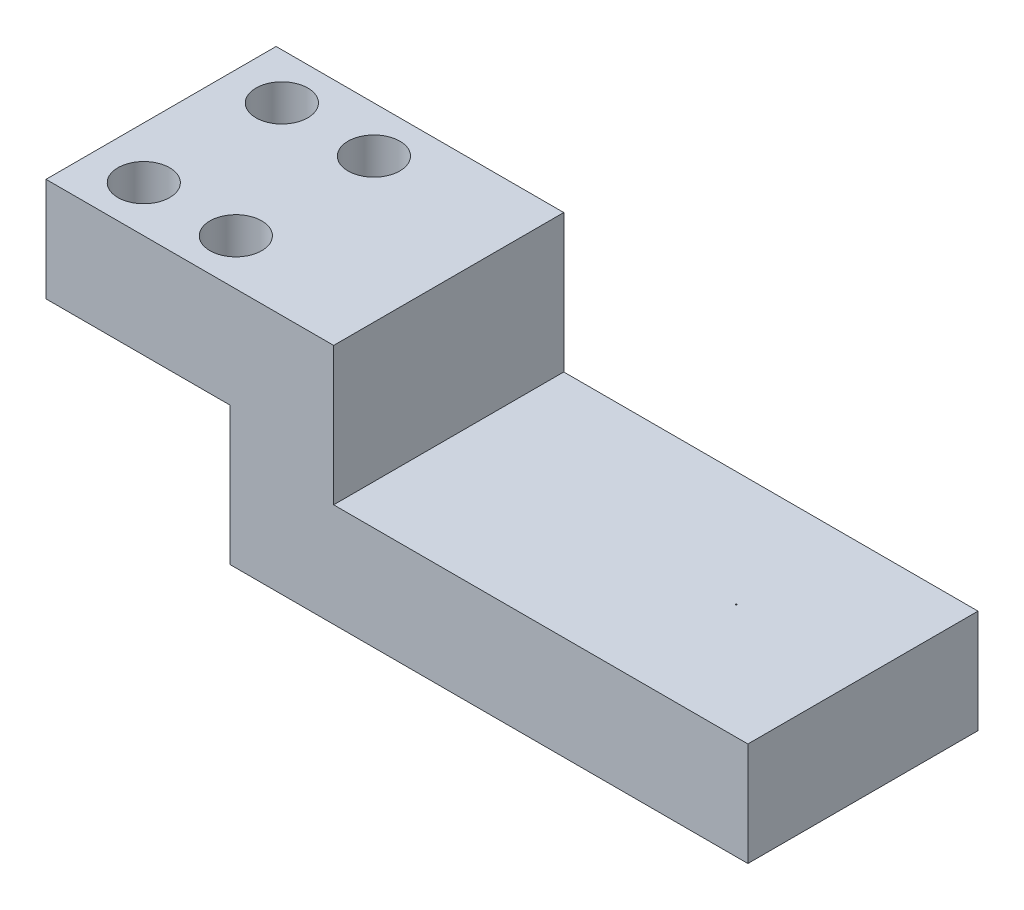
from build123d import *

# Parameters (mm, degrees)
BASE_EXTRUSION_DEPTH    = 10
ESQUISSE2_R             = 2.25
ENL_V_MAT_EXTRU_1_DEPTH = 66.283994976
ESQUISSE3_R             = 0.05
ENL_V_MAT_EXTRU_2_DEPTH = 0.1


with BuildPart() as part:
    # Esquisse1 → Base-Extrusion (new, symmetric)
    with BuildSketch(Plane.XY):
        Polygon((0, 0), (25, 0), (25, -12), (61, -12), (61, -21), (16, -21), (16, -9), (0, -9), align=None)
    extrude(amount=BASE_EXTRUSION_DEPTH, both=True)

    # Esquisse2 → Enl_v. mat.-Extru.1 (cut, through all)
    with BuildSketch(Plane(origin=(0, 0, 0), x_dir=(-1, 0, 0), z_dir=(0, 1, 0))):
        with Locations(Location((-4.5, -6, 0), (0, 0, 90))):
            Circle(ESQUISSE2_R)
        with Locations(Location((-12.5, -6, 0), (0, 0, 90))):
            Circle(ESQUISSE2_R)
        with Locations(Location((-4.5, 6, 0), (0, 0, 90))):
            Circle(ESQUISSE2_R)
        with Locations(Location((-12.5, 6, 0), (0, 0, 90))):
            Circle(ESQUISSE2_R)
    extrude(amount=-ENL_V_MAT_EXTRU_1_DEPTH, mode=Mode.SUBTRACT)

    # Esquisse3 → Enl_v. mat.-Extru.2 (cut)
    with BuildSketch(Plane(origin=(0, -12, 0), x_dir=(-1, 0, 0), z_dir=(0, 1, 0))):
        with Locations((-50, 0)):
            Circle(ESQUISSE3_R)
    extrude(amount=-ENL_V_MAT_EXTRU_2_DEPTH, mode=Mode.SUBTRACT)


solid = part.part
